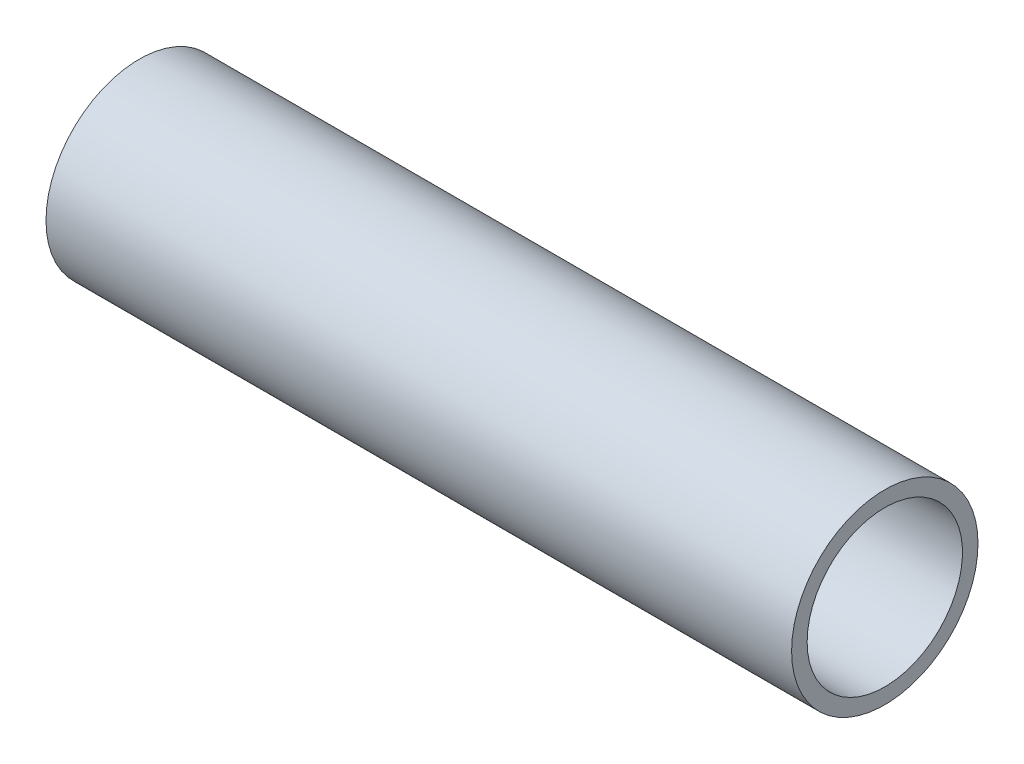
ISO-10303-21;
HEADER;
FILE_DESCRIPTION(('STEP AP214'),'2;1');
FILE_NAME('part.step','',(''),(''),'','','');
FILE_SCHEMA(('AUTOMOTIVE_DESIGN { 1 0 10303 214 1 1 1 1 }'));
ENDSEC;
DATA;
#1=APPLICATION_CONTEXT('core data for automotive mechanical design processes');
#2=APPLICATION_PROTOCOL_DEFINITION('international standard','automotive_design',2000,#1);
#3=PRODUCT_CONTEXT('',#1,'mechanical');
#4=PRODUCT('Part','Part','',(#3));
#5=PRODUCT_RELATED_PRODUCT_CATEGORY('part','',(#4));
#6=PRODUCT_DEFINITION_FORMATION('','',#4);
#7=PRODUCT_DEFINITION_CONTEXT('part definition',#1,'design');
#8=PRODUCT_DEFINITION('design','',#6,#7);
#9=PRODUCT_DEFINITION_SHAPE('','',#8);
#10=(LENGTH_UNIT() NAMED_UNIT(*) SI_UNIT(.MILLI.,.METRE.));
#11=(NAMED_UNIT(*) PLANE_ANGLE_UNIT() SI_UNIT($,.RADIAN.));
#12=(NAMED_UNIT(*) SI_UNIT($,.STERADIAN.) SOLID_ANGLE_UNIT());
#13=UNCERTAINTY_MEASURE_WITH_UNIT(LENGTH_MEASURE(1.E-05),#10,'distance_accuracy_value','');
#14=(GEOMETRIC_REPRESENTATION_CONTEXT(3) GLOBAL_UNCERTAINTY_ASSIGNED_CONTEXT((#13)) GLOBAL_UNIT_ASSIGNED_CONTEXT((#10,
#11,#12)) REPRESENTATION_CONTEXT('',''));
#15=CARTESIAN_POINT('',(0.,0.,0.));
#16=DIRECTION('',(0.,0.,1.));
#17=DIRECTION('',(1.,0.,0.));
#18=AXIS2_PLACEMENT_3D('',#15,#16,#17);
#19=CARTESIAN_POINT('',(-25.5720184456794,0.,0.));
#20=DIRECTION('',(-1.,0.,0.));
#21=DIRECTION('',(0.,0.,1.));
#22=AXIS2_PLACEMENT_3D('',#19,#20,#21);
#23=CYLINDRICAL_SURFACE('',#22,6.);
#24=CARTESIAN_POINT('',(-18.3801768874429,0.,0.));
#25=DIRECTION('',(-1.,0.,0.));
#26=DIRECTION('',(0.,0.,1.));
#27=AXIS2_PLACEMENT_3D('',#24,#25,#26);
#28=CIRCLE('',#27,6.);
#29=CARTESIAN_POINT('',(-18.3801768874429,0.,6.));
#30=VERTEX_POINT('',#29);
#31=EDGE_CURVE('E54',#30,#30,#28,.T.);
#32=ORIENTED_EDGE('',*,*,#31,.F.);
#33=EDGE_LOOP('',(#32));
#34=FACE_BOUND('',#33,.T.);
#35=CARTESIAN_POINT('',(29.6198231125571,0.,0.));
#36=DIRECTION('',(-1.,0.,0.));
#37=DIRECTION('',(0.,0.,1.));
#38=AXIS2_PLACEMENT_3D('',#35,#36,#37);
#39=CIRCLE('',#38,6.);
#40=CARTESIAN_POINT('',(29.6198231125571,0.,6.));
#41=VERTEX_POINT('',#40);
#42=EDGE_CURVE('E10',#41,#41,#39,.T.);
#43=ORIENTED_EDGE('',*,*,#42,.T.);
#44=EDGE_LOOP('',(#43));
#45=FACE_BOUND('',#44,.T.);
#46=ADVANCED_FACE('F37',(#34,#45),#23,.T.);
#47=CARTESIAN_POINT('',(29.6198231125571,6.,0.));
#48=DIRECTION('',(-1.,0.,0.));
#49=DIRECTION('',(0.,0.,1.));
#50=AXIS2_PLACEMENT_3D('',#47,#48,#49);
#51=PLANE('',#50);
#52=ORIENTED_EDGE('',*,*,#42,.F.);
#53=EDGE_LOOP('',(#52));
#54=FACE_BOUND('',#53,.T.);
#55=CARTESIAN_POINT('',(29.6198231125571,0.,0.));
#56=DIRECTION('',(-1.,0.,0.));
#57=DIRECTION('',(0.,0.,1.));
#58=AXIS2_PLACEMENT_3D('',#55,#56,#57);
#59=CIRCLE('',#58,5.);
#60=CARTESIAN_POINT('',(29.6198231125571,0.,5.));
#61=VERTEX_POINT('',#60);
#62=EDGE_CURVE('E44',#61,#61,#59,.T.);
#63=ORIENTED_EDGE('',*,*,#62,.T.);
#64=EDGE_LOOP('',(#63));
#65=FACE_BOUND('',#64,.T.);
#66=ADVANCED_FACE('F64',(#54,#65),#51,.F.);
#67=CARTESIAN_POINT('',(-25.5720184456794,0.,0.));
#68=DIRECTION('',(-1.,0.,0.));
#69=DIRECTION('',(0.,0.,1.));
#70=AXIS2_PLACEMENT_3D('',#67,#68,#69);
#71=CYLINDRICAL_SURFACE('',#70,5.);
#72=ORIENTED_EDGE('',*,*,#62,.F.);
#73=EDGE_LOOP('',(#72));
#74=FACE_BOUND('',#73,.T.);
#75=CARTESIAN_POINT('',(-18.3801768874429,0.,0.));
#76=DIRECTION('',(-1.,0.,0.));
#77=DIRECTION('',(0.,0.,1.));
#78=AXIS2_PLACEMENT_3D('',#75,#76,#77);
#79=CIRCLE('',#78,5.);
#80=CARTESIAN_POINT('',(-18.3801768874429,0.,5.));
#81=VERTEX_POINT('',#80);
#82=EDGE_CURVE('E49',#81,#81,#79,.T.);
#83=ORIENTED_EDGE('',*,*,#82,.T.);
#84=EDGE_LOOP('',(#83));
#85=FACE_BOUND('',#84,.T.);
#86=ADVANCED_FACE('F68',(#74,#85),#71,.F.);
#87=CARTESIAN_POINT('',(-18.3801768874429,5.,0.));
#88=DIRECTION('',(1.,0.,0.));
#89=DIRECTION('',(0.,0.,-1.));
#90=AXIS2_PLACEMENT_3D('',#87,#88,#89);
#91=PLANE('',#90);
#92=ORIENTED_EDGE('',*,*,#82,.F.);
#93=EDGE_LOOP('',(#92));
#94=FACE_BOUND('',#93,.T.);
#95=ORIENTED_EDGE('',*,*,#31,.T.);
#96=EDGE_LOOP('',(#95));
#97=FACE_BOUND('',#96,.T.);
#98=ADVANCED_FACE('F61',(#94,#97),#91,.F.);
#99=CLOSED_SHELL('',(#46,#66,#86,#98));
#100=MANIFOLD_SOLID_BREP('B2',#99);
#101=ADVANCED_BREP_SHAPE_REPRESENTATION('',(#18,#100),#14);
#102=SHAPE_DEFINITION_REPRESENTATION(#9,#101);
ENDSEC;
END-ISO-10303-21;
